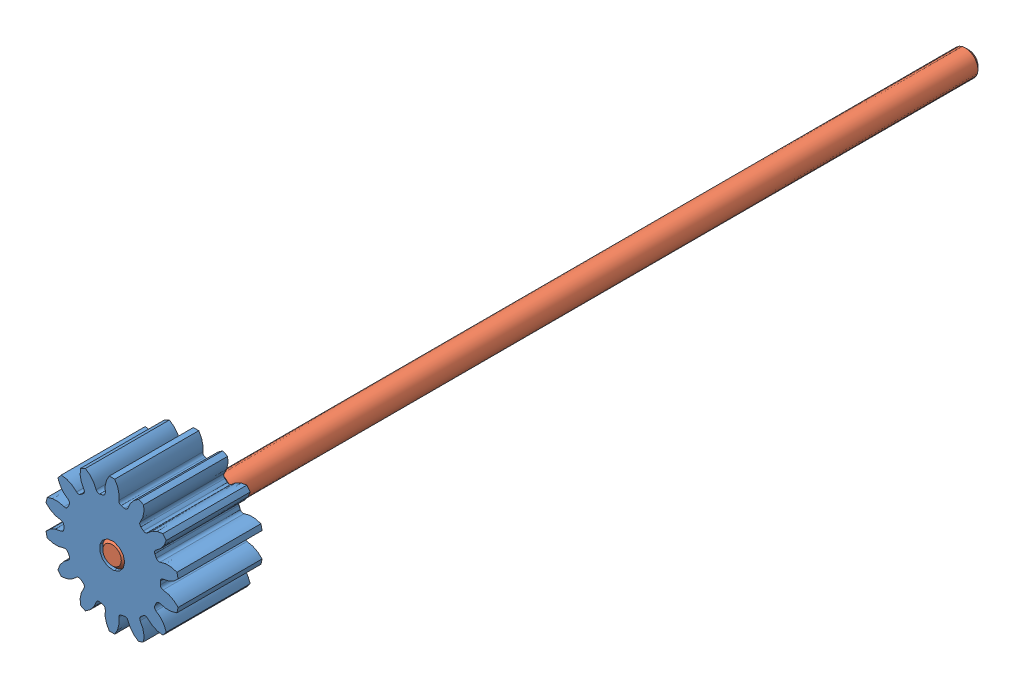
SolidWorks assembly arbre_moteur.SLDASM, configuration Défaut (file format 5000). Lengths in mm.
Overall size (54.58 54.58 54.58).
2 component instances, 2 part files, 2 mates.
Components (placement in the parent):
- pignon_moteur-1: pignon_moteur.SLDPRT [Défaut] at origin size (7.86 8 5.3)
- axe_moteur-1: axe_moteur.SLDPRT [Défaut] at (0 0 -45.7) x (0.966368 0.257162 0) z (0 0 1) size (1.5 1.5 51)
Mates (geometry in assembly coordinates):
- Coïncidente1: coincident aligned: plane of pignon_moteur-1 through (0 0 5.3) normal (0 0 1); plane of axe_moteur-1 through (0 0 5.3) normal (0 0 1)
- Coaxiale1: concentric anti-aligned: cylinder of pignon_moteur-1 through (0 0 -0.001) axis (0 0 1) radius 0.75; cylinder of axe_moteur-1 through (0 0 5.3) axis (0 0 -1) radius 0.75
